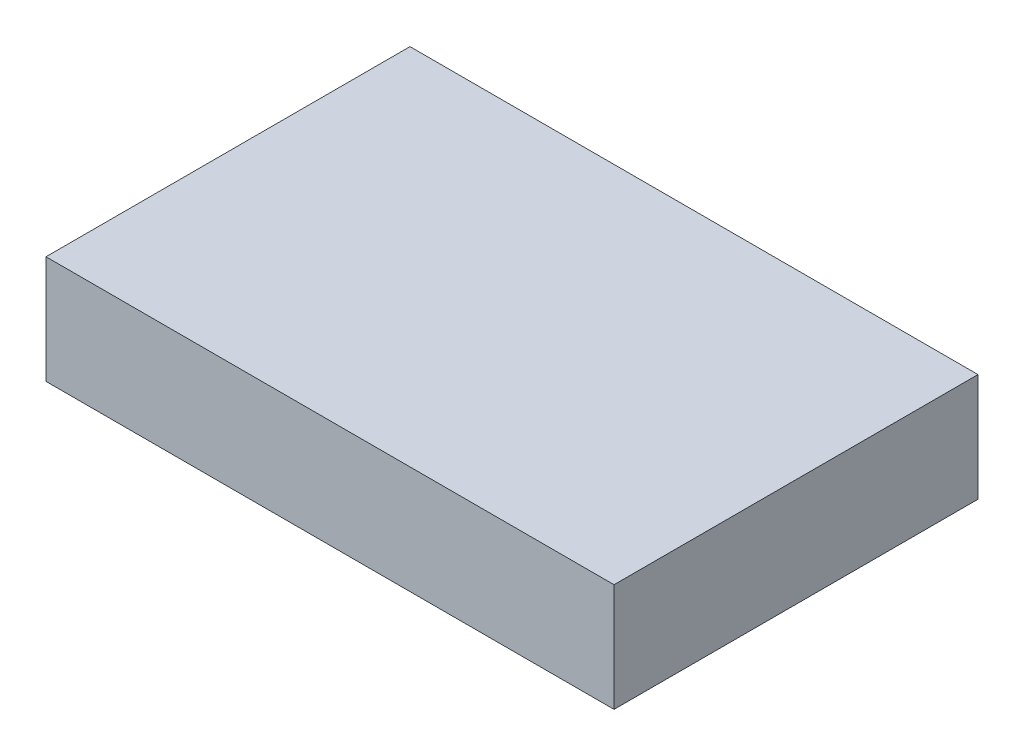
from build123d import *

# Parameters (mm, degrees)
SKETCH1_W      = 173.591221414
SKETCH1_H      = 111.229315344
EXTRUDE1_DEPTH = 33


with BuildPart() as part:
    # Sketch1 → Extrude1 (new body)
    with BuildSketch(Plane(origin=(0, 0, 0), x_dir=(1, 0, 0), z_dir=(0, 1, 0))):
        Rectangle(SKETCH1_W, SKETCH1_H)
    extrude(amount=EXTRUDE1_DEPTH)


solid = part.part
